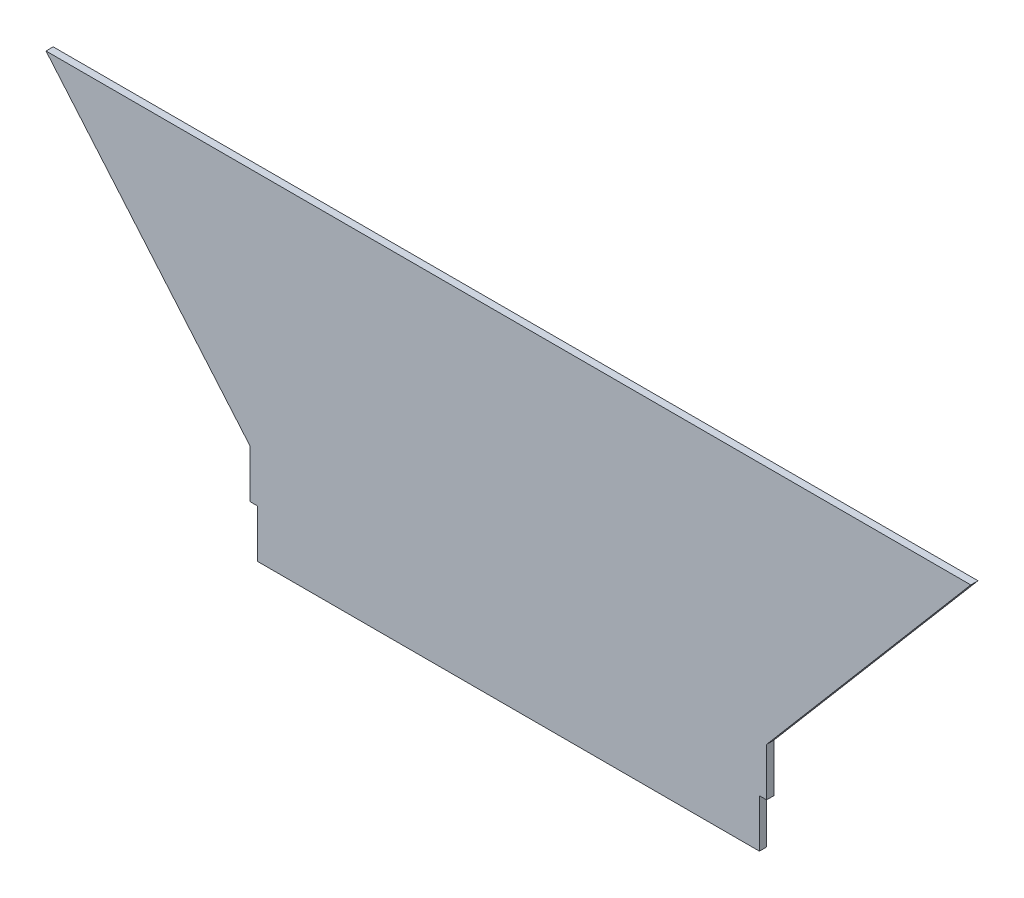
ISO-10303-21;
HEADER;
FILE_DESCRIPTION(('STEP AP214'),'2;1');
FILE_NAME('part.step','',(''),(''),'','','');
FILE_SCHEMA(('AUTOMOTIVE_DESIGN { 1 0 10303 214 1 1 1 1 }'));
ENDSEC;
DATA;
#1=APPLICATION_CONTEXT('core data for automotive mechanical design processes');
#2=APPLICATION_PROTOCOL_DEFINITION('international standard','automotive_design',2000,#1);
#3=PRODUCT_CONTEXT('',#1,'mechanical');
#4=PRODUCT('Part','Part','',(#3));
#5=PRODUCT_RELATED_PRODUCT_CATEGORY('part','',(#4));
#6=PRODUCT_DEFINITION_FORMATION('','',#4);
#7=PRODUCT_DEFINITION_CONTEXT('part definition',#1,'design');
#8=PRODUCT_DEFINITION('design','',#6,#7);
#9=PRODUCT_DEFINITION_SHAPE('','',#8);
#10=(LENGTH_UNIT() NAMED_UNIT(*) SI_UNIT(.MILLI.,.METRE.));
#11=(NAMED_UNIT(*) PLANE_ANGLE_UNIT() SI_UNIT($,.RADIAN.));
#12=(NAMED_UNIT(*) SI_UNIT($,.STERADIAN.) SOLID_ANGLE_UNIT());
#13=UNCERTAINTY_MEASURE_WITH_UNIT(LENGTH_MEASURE(1.E-05),#10,'distance_accuracy_value','');
#14=(GEOMETRIC_REPRESENTATION_CONTEXT(3) GLOBAL_UNCERTAINTY_ASSIGNED_CONTEXT((#13)) GLOBAL_UNIT_ASSIGNED_CONTEXT((#10,
#11,#12)) REPRESENTATION_CONTEXT('',''));
#15=CARTESIAN_POINT('',(0.,0.,0.));
#16=DIRECTION('',(0.,0.,1.));
#17=DIRECTION('',(1.,0.,0.));
#18=AXIS2_PLACEMENT_3D('',#15,#16,#17);
#19=CARTESIAN_POINT('',(-107.5,-70.,3.));
#20=DIRECTION('',(0.,1.,0.));
#21=DIRECTION('',(0.,0.,1.));
#22=AXIS2_PLACEMENT_3D('',#19,#20,#21);
#23=PLANE('',#22);
#24=DIRECTION('',(0.,0.,-1.));
#25=VECTOR('',#24,1.);
#26=CARTESIAN_POINT('',(-104.5,-70.,3.));
#27=LINE('',#26,#25);
#28=CARTESIAN_POINT('',(-104.5,-70.,3.));
#29=VERTEX_POINT('',#28);
#30=CARTESIAN_POINT('',(-104.5,-70.,0.));
#31=VERTEX_POINT('',#30);
#32=EDGE_CURVE('E115',#29,#31,#27,.T.);
#33=ORIENTED_EDGE('',*,*,#32,.T.);
#34=DIRECTION('',(1.,0.,0.));
#35=VECTOR('',#34,1.);
#36=CARTESIAN_POINT('',(-107.5,-70.,0.));
#37=LINE('',#36,#35);
#38=CARTESIAN_POINT('',(104.5,-70.,0.));
#39=VERTEX_POINT('',#38);
#40=EDGE_CURVE('E39',#31,#39,#37,.T.);
#41=ORIENTED_EDGE('',*,*,#40,.T.);
#42=DIRECTION('',(0.,0.,-1.));
#43=VECTOR('',#42,1.);
#44=CARTESIAN_POINT('',(104.5,-70.,3.));
#45=LINE('',#44,#43);
#46=CARTESIAN_POINT('',(104.5,-70.,3.));
#47=VERTEX_POINT('',#46);
#48=EDGE_CURVE('E134',#47,#39,#45,.T.);
#49=ORIENTED_EDGE('',*,*,#48,.F.);
#50=DIRECTION('',(1.,0.,0.));
#51=VECTOR('',#50,1.);
#52=CARTESIAN_POINT('',(-107.5,-70.,3.));
#53=LINE('',#52,#51);
#54=EDGE_CURVE('E11',#29,#47,#53,.T.);
#55=ORIENTED_EDGE('',*,*,#54,.F.);
#56=EDGE_LOOP('',(#33,#41,#49,#55));
#57=FACE_BOUND('',#56,.T.);
#58=ADVANCED_FACE('F35',(#57),#23,.F.);
#59=CARTESIAN_POINT('',(0.,0.,3.));
#60=DIRECTION('',(0.,0.,-1.));
#61=DIRECTION('',(-1.,0.,0.));
#62=AXIS2_PLACEMENT_3D('',#59,#60,#61);
#63=PLANE('',#62);
#64=DIRECTION('',(-1.,0.,0.));
#65=VECTOR('',#64,1.);
#66=CARTESIAN_POINT('',(-104.5,-50.,3.));
#67=LINE('',#66,#65);
#68=CARTESIAN_POINT('',(-104.5,-50.,3.));
#69=VERTEX_POINT('',#68);
#70=CARTESIAN_POINT('',(-107.5,-50.,3.));
#71=VERTEX_POINT('',#70);
#72=EDGE_CURVE('E52',#69,#71,#67,.T.);
#73=ORIENTED_EDGE('',*,*,#72,.F.);
#74=DIRECTION('',(0.,1.,0.));
#75=VECTOR('',#74,1.);
#76=CARTESIAN_POINT('',(-104.5,-50.,3.));
#77=LINE('',#76,#75);
#78=EDGE_CURVE('E118',#29,#69,#77,.T.);
#79=ORIENTED_EDGE('',*,*,#78,.F.);
#80=ORIENTED_EDGE('',*,*,#54,.T.);
#81=DIRECTION('',(0.,-1.,0.));
#82=VECTOR('',#81,1.);
#83=CARTESIAN_POINT('',(104.5,-50.,3.));
#84=LINE('',#83,#82);
#85=CARTESIAN_POINT('',(104.5,-50.,3.));
#86=VERTEX_POINT('',#85);
#87=EDGE_CURVE('E191',#86,#47,#84,.T.);
#88=ORIENTED_EDGE('',*,*,#87,.F.);
#89=DIRECTION('',(-1.,0.,0.));
#90=VECTOR('',#89,1.);
#91=CARTESIAN_POINT('',(104.5,-50.,3.));
#92=LINE('',#91,#90);
#93=CARTESIAN_POINT('',(107.5,-50.,3.));
#94=VERTEX_POINT('',#93);
#95=EDGE_CURVE('E193',#94,#86,#92,.T.);
#96=ORIENTED_EDGE('',*,*,#95,.F.);
#97=DIRECTION('',(0.,1.,0.));
#98=VECTOR('',#97,1.);
#99=CARTESIAN_POINT('',(107.5,-70.,3.));
#100=LINE('',#99,#98);
#101=CARTESIAN_POINT('',(107.5,-30.,3.));
#102=VERTEX_POINT('',#101);
#103=EDGE_CURVE('E167',#94,#102,#100,.T.);
#104=ORIENTED_EDGE('',*,*,#103,.T.);
#105=DIRECTION('',(0.64764842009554,0.761939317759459,0.));
#106=VECTOR('',#105,1.);
#107=CARTESIAN_POINT('',(192.5,70.,3.));
#108=LINE('',#107,#106);
#109=CARTESIAN_POINT('',(192.5,70.,3.));
#110=VERTEX_POINT('',#109);
#111=EDGE_CURVE('E146',#102,#110,#108,.T.);
#112=ORIENTED_EDGE('',*,*,#111,.T.);
#113=DIRECTION('',(-1.,0.,0.));
#114=VECTOR('',#113,1.);
#115=CARTESIAN_POINT('',(-107.5,70.,3.));
#116=LINE('',#115,#114);
#117=CARTESIAN_POINT('',(-192.5,70.,3.));
#118=VERTEX_POINT('',#117);
#119=EDGE_CURVE('E169',#110,#118,#116,.T.);
#120=ORIENTED_EDGE('',*,*,#119,.T.);
#121=DIRECTION('',(0.64764842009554,-0.761939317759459,0.));
#122=VECTOR('',#121,1.);
#123=CARTESIAN_POINT('',(-107.5,-30.,3.));
#124=LINE('',#123,#122);
#125=CARTESIAN_POINT('',(-107.5,-30.,3.));
#126=VERTEX_POINT('',#125);
#127=EDGE_CURVE('E149',#118,#126,#124,.T.);
#128=ORIENTED_EDGE('',*,*,#127,.T.);
#129=DIRECTION('',(0.,-1.,0.));
#130=VECTOR('',#129,1.);
#131=CARTESIAN_POINT('',(-107.5,-70.,3.));
#132=LINE('',#131,#130);
#133=EDGE_CURVE('E44',#126,#71,#132,.T.);
#134=ORIENTED_EDGE('',*,*,#133,.T.);
#135=EDGE_LOOP('',(#73,#79,#80,#88,#96,#104,#112,#120,#128,#134));
#136=FACE_BOUND('',#135,.T.);
#137=ADVANCED_FACE('F128',(#136),#63,.F.);
#138=CARTESIAN_POINT('',(0.,0.,0.));
#139=DIRECTION('',(0.,0.,-1.));
#140=DIRECTION('',(-1.,0.,0.));
#141=AXIS2_PLACEMENT_3D('',#138,#139,#140);
#142=PLANE('',#141);
#143=DIRECTION('',(0.,1.,0.));
#144=VECTOR('',#143,1.);
#145=CARTESIAN_POINT('',(-104.5,-50.,0.));
#146=LINE('',#145,#144);
#147=CARTESIAN_POINT('',(-104.5,-50.,0.));
#148=VERTEX_POINT('',#147);
#149=EDGE_CURVE('E120',#31,#148,#146,.T.);
#150=ORIENTED_EDGE('',*,*,#149,.T.);
#151=DIRECTION('',(-1.,0.,0.));
#152=VECTOR('',#151,1.);
#153=CARTESIAN_POINT('',(-104.5,-50.,0.));
#154=LINE('',#153,#152);
#155=CARTESIAN_POINT('',(-107.5,-50.,0.));
#156=VERTEX_POINT('',#155);
#157=EDGE_CURVE('E184',#148,#156,#154,.T.);
#158=ORIENTED_EDGE('',*,*,#157,.T.);
#159=DIRECTION('',(0.,-1.,0.));
#160=VECTOR('',#159,1.);
#161=CARTESIAN_POINT('',(-107.5,-70.,0.));
#162=LINE('',#161,#160);
#163=CARTESIAN_POINT('',(-107.5,-30.,0.));
#164=VERTEX_POINT('',#163);
#165=EDGE_CURVE('E174',#164,#156,#162,.T.);
#166=ORIENTED_EDGE('',*,*,#165,.F.);
#167=DIRECTION('',(0.64764842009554,-0.761939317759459,0.));
#168=VECTOR('',#167,1.);
#169=CARTESIAN_POINT('',(-107.5,-30.,0.));
#170=LINE('',#169,#168);
#171=CARTESIAN_POINT('',(-192.5,70.,0.));
#172=VERTEX_POINT('',#171);
#173=EDGE_CURVE('E139',#172,#164,#170,.T.);
#174=ORIENTED_EDGE('',*,*,#173,.F.);
#175=DIRECTION('',(-1.,0.,0.));
#176=VECTOR('',#175,1.);
#177=CARTESIAN_POINT('',(-107.5,70.,0.));
#178=LINE('',#177,#176);
#179=CARTESIAN_POINT('',(192.5,70.,0.));
#180=VERTEX_POINT('',#179);
#181=EDGE_CURVE('E173',#180,#172,#178,.T.);
#182=ORIENTED_EDGE('',*,*,#181,.F.);
#183=DIRECTION('',(0.64764842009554,0.761939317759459,0.));
#184=VECTOR('',#183,1.);
#185=CARTESIAN_POINT('',(192.5,70.,0.));
#186=LINE('',#185,#184);
#187=CARTESIAN_POINT('',(107.5,-30.,0.));
#188=VERTEX_POINT('',#187);
#189=EDGE_CURVE('E135',#188,#180,#186,.T.);
#190=ORIENTED_EDGE('',*,*,#189,.F.);
#191=DIRECTION('',(0.,1.,0.));
#192=VECTOR('',#191,1.);
#193=CARTESIAN_POINT('',(107.5,-70.,0.));
#194=LINE('',#193,#192);
#195=CARTESIAN_POINT('',(107.5,-50.,0.));
#196=VERTEX_POINT('',#195);
#197=EDGE_CURVE('E166',#196,#188,#194,.T.);
#198=ORIENTED_EDGE('',*,*,#197,.F.);
#199=DIRECTION('',(-1.,0.,0.));
#200=VECTOR('',#199,1.);
#201=CARTESIAN_POINT('',(104.5,-50.,0.));
#202=LINE('',#201,#200);
#203=CARTESIAN_POINT('',(104.5,-50.,0.));
#204=VERTEX_POINT('',#203);
#205=EDGE_CURVE('E194',#196,#204,#202,.T.);
#206=ORIENTED_EDGE('',*,*,#205,.T.);
#207=DIRECTION('',(0.,-1.,0.));
#208=VECTOR('',#207,1.);
#209=CARTESIAN_POINT('',(104.5,-50.,0.));
#210=LINE('',#209,#208);
#211=EDGE_CURVE('E60',#204,#39,#210,.T.);
#212=ORIENTED_EDGE('',*,*,#211,.T.);
#213=ORIENTED_EDGE('',*,*,#40,.F.);
#214=EDGE_LOOP('',(#150,#158,#166,#174,#182,#190,#198,#206,#212,#213));
#215=FACE_BOUND('',#214,.T.);
#216=ADVANCED_FACE('F182',(#215),#142,.T.);
#217=CARTESIAN_POINT('',(-107.5,-70.,3.));
#218=DIRECTION('',(1.,0.,0.));
#219=DIRECTION('',(0.,0.,-1.));
#220=AXIS2_PLACEMENT_3D('',#217,#218,#219);
#221=PLANE('',#220);
#222=DIRECTION('',(0.,0.,-1.));
#223=VECTOR('',#222,1.);
#224=CARTESIAN_POINT('',(-107.5,-50.,3.));
#225=LINE('',#224,#223);
#226=EDGE_CURVE('E124',#71,#156,#225,.T.);
#227=ORIENTED_EDGE('',*,*,#226,.F.);
#228=ORIENTED_EDGE('',*,*,#133,.F.);
#229=DIRECTION('',(0.,0.,-1.));
#230=VECTOR('',#229,1.);
#231=CARTESIAN_POINT('',(-107.5,-30.,3.));
#232=LINE('',#231,#230);
#233=EDGE_CURVE('E151',#126,#164,#232,.T.);
#234=ORIENTED_EDGE('',*,*,#233,.T.);
#235=ORIENTED_EDGE('',*,*,#165,.T.);
#236=EDGE_LOOP('',(#227,#228,#234,#235));
#237=FACE_BOUND('',#236,.T.);
#238=ADVANCED_FACE('F177',(#237),#221,.F.);
#239=CARTESIAN_POINT('',(107.5,-70.,3.));
#240=DIRECTION('',(-1.,0.,0.));
#241=DIRECTION('',(0.,0.,1.));
#242=AXIS2_PLACEMENT_3D('',#239,#240,#241);
#243=PLANE('',#242);
#244=DIRECTION('',(0.,0.,-1.));
#245=VECTOR('',#244,1.);
#246=CARTESIAN_POINT('',(107.5,-50.,3.));
#247=LINE('',#246,#245);
#248=EDGE_CURVE('E136',#94,#196,#247,.T.);
#249=ORIENTED_EDGE('',*,*,#248,.T.);
#250=ORIENTED_EDGE('',*,*,#197,.T.);
#251=DIRECTION('',(0.,0.,-1.));
#252=VECTOR('',#251,1.);
#253=CARTESIAN_POINT('',(107.5,-30.,3.));
#254=LINE('',#253,#252);
#255=EDGE_CURVE('E163',#102,#188,#254,.T.);
#256=ORIENTED_EDGE('',*,*,#255,.F.);
#257=ORIENTED_EDGE('',*,*,#103,.F.);
#258=EDGE_LOOP('',(#249,#250,#256,#257));
#259=FACE_BOUND('',#258,.T.);
#260=ADVANCED_FACE('F37',(#259),#243,.F.);
#261=CARTESIAN_POINT('',(-107.5,70.,3.));
#262=DIRECTION('',(0.,-1.,0.));
#263=DIRECTION('',(0.,0.,-1.));
#264=AXIS2_PLACEMENT_3D('',#261,#262,#263);
#265=PLANE('',#264);
#266=ORIENTED_EDGE('',*,*,#181,.T.);
#267=DIRECTION('',(0.,0.,-1.));
#268=VECTOR('',#267,1.);
#269=CARTESIAN_POINT('',(-192.5,70.,3.));
#270=LINE('',#269,#268);
#271=EDGE_CURVE('E157',#118,#172,#270,.T.);
#272=ORIENTED_EDGE('',*,*,#271,.F.);
#273=ORIENTED_EDGE('',*,*,#119,.F.);
#274=DIRECTION('',(0.,0.,-1.));
#275=VECTOR('',#274,1.);
#276=CARTESIAN_POINT('',(192.5,70.,3.));
#277=LINE('',#276,#275);
#278=EDGE_CURVE('E160',#110,#180,#277,.T.);
#279=ORIENTED_EDGE('',*,*,#278,.T.);
#280=EDGE_LOOP('',(#266,#272,#273,#279));
#281=FACE_BOUND('',#280,.T.);
#282=ADVANCED_FACE('F232',(#281),#265,.F.);
#283=CARTESIAN_POINT('',(-107.5,-30.,3.));
#284=DIRECTION('',(0.761939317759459,0.64764842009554,0.));
#285=DIRECTION('',(-0.64764842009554,0.761939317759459,0.));
#286=AXIS2_PLACEMENT_3D('',#283,#284,#285);
#287=PLANE('',#286);
#288=ORIENTED_EDGE('',*,*,#173,.T.);
#289=ORIENTED_EDGE('',*,*,#233,.F.);
#290=ORIENTED_EDGE('',*,*,#127,.F.);
#291=ORIENTED_EDGE('',*,*,#271,.T.);
#292=EDGE_LOOP('',(#288,#289,#290,#291));
#293=FACE_BOUND('',#292,.T.);
#294=ADVANCED_FACE('F217',(#293),#287,.F.);
#295=CARTESIAN_POINT('',(192.5,70.,3.));
#296=DIRECTION('',(-0.761939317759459,0.64764842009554,0.));
#297=DIRECTION('',(-0.64764842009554,-0.761939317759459,0.));
#298=AXIS2_PLACEMENT_3D('',#295,#296,#297);
#299=PLANE('',#298);
#300=ORIENTED_EDGE('',*,*,#189,.T.);
#301=ORIENTED_EDGE('',*,*,#278,.F.);
#302=ORIENTED_EDGE('',*,*,#111,.F.);
#303=ORIENTED_EDGE('',*,*,#255,.T.);
#304=EDGE_LOOP('',(#300,#301,#302,#303));
#305=FACE_BOUND('',#304,.T.);
#306=ADVANCED_FACE('F209',(#305),#299,.F.);
#307=CARTESIAN_POINT('',(104.5,-50.,3.));
#308=DIRECTION('',(1.,0.,0.));
#309=DIRECTION('',(0.,1.,0.));
#310=AXIS2_PLACEMENT_3D('',#307,#308,#309);
#311=PLANE('',#310);
#312=ORIENTED_EDGE('',*,*,#211,.F.);
#313=DIRECTION('',(0.,0.,-1.));
#314=VECTOR('',#313,1.);
#315=CARTESIAN_POINT('',(104.5,-50.,3.));
#316=LINE('',#315,#314);
#317=EDGE_CURVE('E142',#86,#204,#316,.T.);
#318=ORIENTED_EDGE('',*,*,#317,.F.);
#319=ORIENTED_EDGE('',*,*,#87,.T.);
#320=ORIENTED_EDGE('',*,*,#48,.T.);
#321=EDGE_LOOP('',(#312,#318,#319,#320));
#322=FACE_BOUND('',#321,.T.);
#323=ADVANCED_FACE('F207',(#322),#311,.T.);
#324=CARTESIAN_POINT('',(104.5,-50.,3.));
#325=DIRECTION('',(0.,-1.,0.));
#326=DIRECTION('',(0.,0.,-1.));
#327=AXIS2_PLACEMENT_3D('',#324,#325,#326);
#328=PLANE('',#327);
#329=ORIENTED_EDGE('',*,*,#205,.F.);
#330=ORIENTED_EDGE('',*,*,#248,.F.);
#331=ORIENTED_EDGE('',*,*,#95,.T.);
#332=ORIENTED_EDGE('',*,*,#317,.T.);
#333=EDGE_LOOP('',(#329,#330,#331,#332));
#334=FACE_BOUND('',#333,.T.);
#335=ADVANCED_FACE('F199',(#334),#328,.T.);
#336=CARTESIAN_POINT('',(-104.5,-50.,3.));
#337=DIRECTION('',(0.,-1.,0.));
#338=DIRECTION('',(0.,0.,-1.));
#339=AXIS2_PLACEMENT_3D('',#336,#337,#338);
#340=PLANE('',#339);
#341=ORIENTED_EDGE('',*,*,#157,.F.);
#342=DIRECTION('',(0.,0.,-1.));
#343=VECTOR('',#342,1.);
#344=CARTESIAN_POINT('',(-104.5,-50.,3.));
#345=LINE('',#344,#343);
#346=EDGE_CURVE('E125',#69,#148,#345,.T.);
#347=ORIENTED_EDGE('',*,*,#346,.F.);
#348=ORIENTED_EDGE('',*,*,#72,.T.);
#349=ORIENTED_EDGE('',*,*,#226,.T.);
#350=EDGE_LOOP('',(#341,#347,#348,#349));
#351=FACE_BOUND('',#350,.T.);
#352=ADVANCED_FACE('F215',(#351),#340,.T.);
#353=CARTESIAN_POINT('',(-104.5,-50.,3.));
#354=DIRECTION('',(-1.,0.,0.));
#355=DIRECTION('',(0.,-1.,0.));
#356=AXIS2_PLACEMENT_3D('',#353,#354,#355);
#357=PLANE('',#356);
#358=ORIENTED_EDGE('',*,*,#149,.F.);
#359=ORIENTED_EDGE('',*,*,#32,.F.);
#360=ORIENTED_EDGE('',*,*,#78,.T.);
#361=ORIENTED_EDGE('',*,*,#346,.T.);
#362=EDGE_LOOP('',(#358,#359,#360,#361));
#363=FACE_BOUND('',#362,.T.);
#364=ADVANCED_FACE('F117',(#363),#357,.T.);
#365=CLOSED_SHELL('',(#58,#137,#216,#238,#260,#282,#294,#306,#323,#335,#352,#364));
#366=MANIFOLD_SOLID_BREP('B2',#365);
#367=ADVANCED_BREP_SHAPE_REPRESENTATION('',(#18,#366),#14);
#368=SHAPE_DEFINITION_REPRESENTATION(#9,#367);
ENDSEC;
END-ISO-10303-21;
